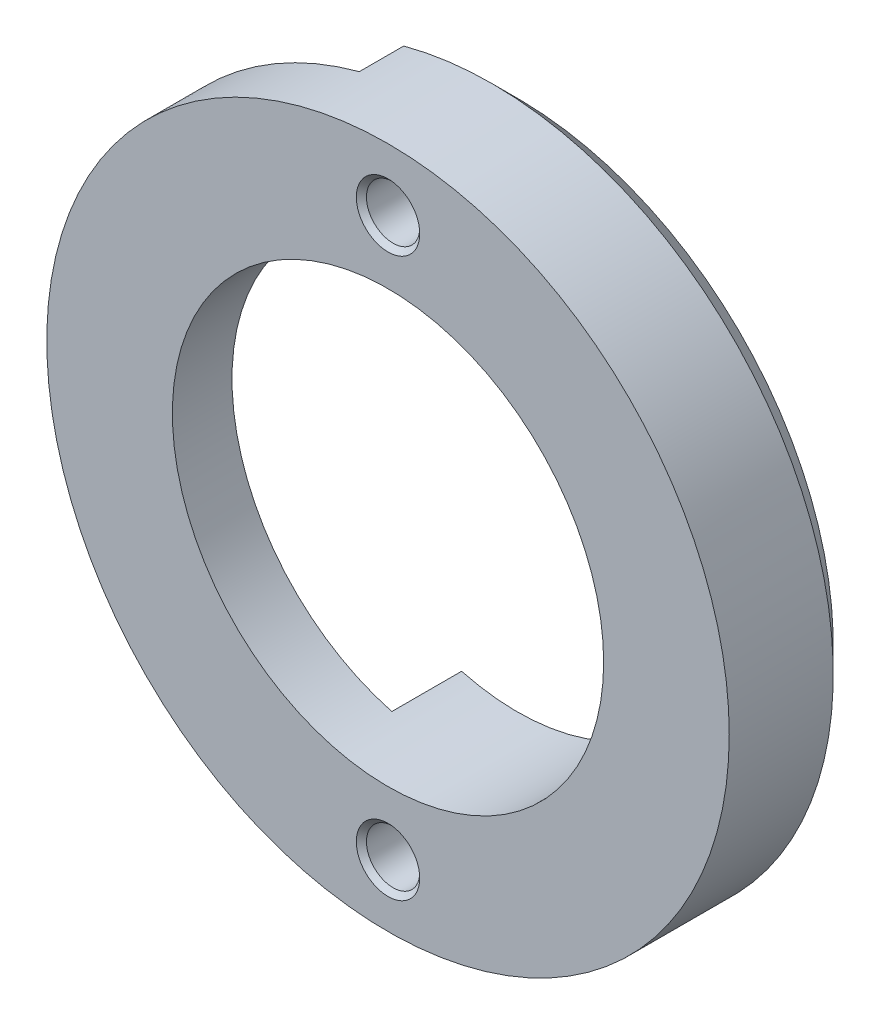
from build123d import *
from build123d.topology import SkipClean

# Parameters (mm, degrees)
ESQUISSE1_R                     = 26.9
ESQUISSE1_R_2                   = 17
EXTRUSION1_DEPTH                = 4.7
EXTRUSION2_START                = 5.5
EXTRUSION2_DEPTH                = 5.5
TROU_TARAUD_M5X0_81_D           = 4.2
TROU_TARAUD_M5X0_81_CSINK_D     = 5
TROU_TARAUD_M5X0_81_CSINK_ANGLE = 90
CHANFREIN1_SIZE                 = 2


with BuildPart() as part:
    # Esquisse1 → Extrusion1 (new body)
    with BuildSketch(Plane.XY):
        Circle(ESQUISSE1_R)
        Circle(ESQUISSE1_R_2, mode=Mode.SUBTRACT)
    extrude(amount=EXTRUSION1_DEPTH)

    # Esquisse2 → Extrusion2 (add)
    with SkipClean():  # the faces are left unmerged after this step: merging them gives an invalid solid
        with BuildSketch(Plane(origin=(0, 0, 0), x_dir=(-1, 0, 0), z_dir=(0, 0, -1)).offset(EXTRUSION2_START)):
            with BuildLine():
                Line((4.399923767, 16.420739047), (6.962232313, 25.983404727))
                ThreePointArc((6.962232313, 25.983404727), (-26.9, 0), (6.962232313, -25.983404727))
                Line((6.962232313, -25.983404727), (4.399923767, -16.420739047))
                ThreePointArc((4.399923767, -16.420739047), (-17, 0), (4.399923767, 16.420739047))
            make_face()
        extrude(amount=-EXTRUSION2_DEPTH)

    # Trou taraud_ M5x0.81 (through all)
    with Locations(Plane.XY.offset(4.7)):
        with Locations((0, -22), (0, 22)):
            CounterSinkHole(TROU_TARAUD_M5X0_81_D / 2, TROU_TARAUD_M5X0_81_CSINK_D / 2, counter_sink_angle=TROU_TARAUD_M5X0_81_CSINK_ANGLE)

    # Chanfrein1
    chanfrein1_edges = [part.edges().sort_by_distance(p)[0] for p in [
        (26.9, 0, -5.5),
    ]]
    chamfer(chanfrein1_edges, length=CHANFREIN1_SIZE)


solid = part.part
